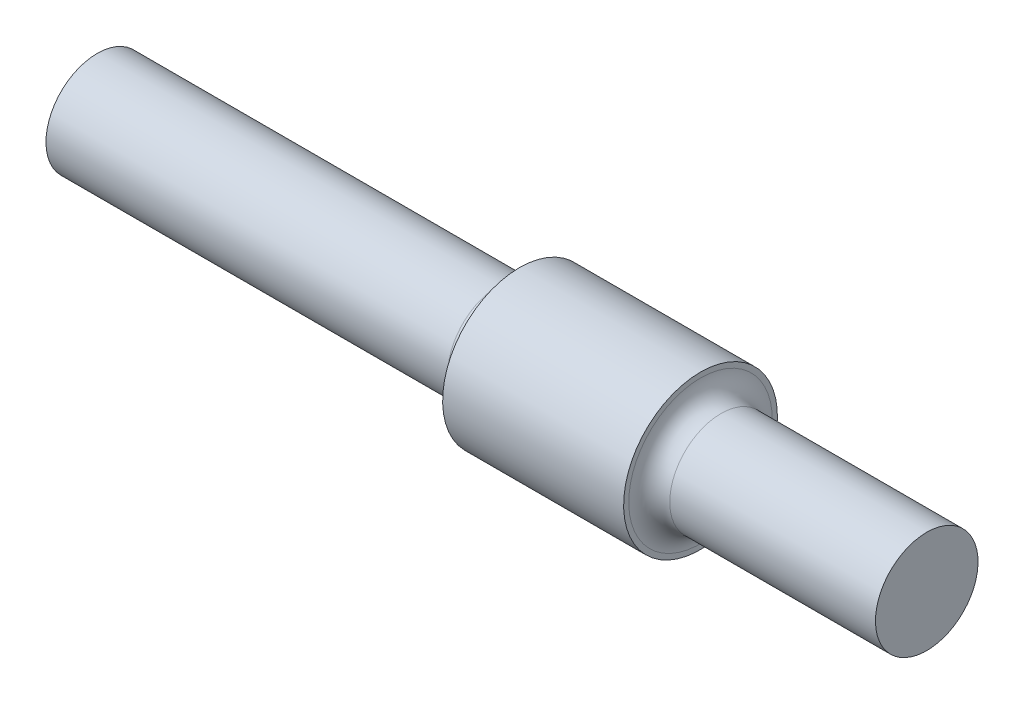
from build123d import *

# Parameters (mm, degrees)
FILLET1_R          = 3.4
CUT_EXTRUDE1_DEPTH = 1


with BuildPart() as part:
    # Sketch1 → Revolve1 (revolve)
    with BuildSketch(Plane.XY):
        Polygon((0, 12.75), (0, 21.25), (70, 21.25), (70, 25.5), (100, 25.5), (100, 21.25), (137.5, 21.25), (137.5, 12.75), align=None)
    revolve(axis=Axis((137.5, 12.75, 0), (-1, 0, 0)))

    # Fillet1
    fillet1_edges = [part.edges().sort_by_distance(p)[0] for p in [
        (100, 4.25, 0),
        (70, 4.25, 0),
    ]]
    fillet(fillet1_edges, radius=FILLET1_R)

    # Sketch2 → Cut-Extrude1 (cut)
    with BuildSketch(Plane(origin=(0, 0, 0), x_dir=(1, 0, 0), z_dir=(0, 1, 0))):
        with BuildLine():
            Line((94, 1), (76, 1))
            ThreePointArc((76, 1), (75, 0), (76, -1))
            Line((76, -1), (94, -1))
            ThreePointArc((94, -1), (95, 0), (94, 1))
        make_face()
    extrude(amount=CUT_EXTRUDE1_DEPTH, mode=Mode.SUBTRACT)


solid = part.part
